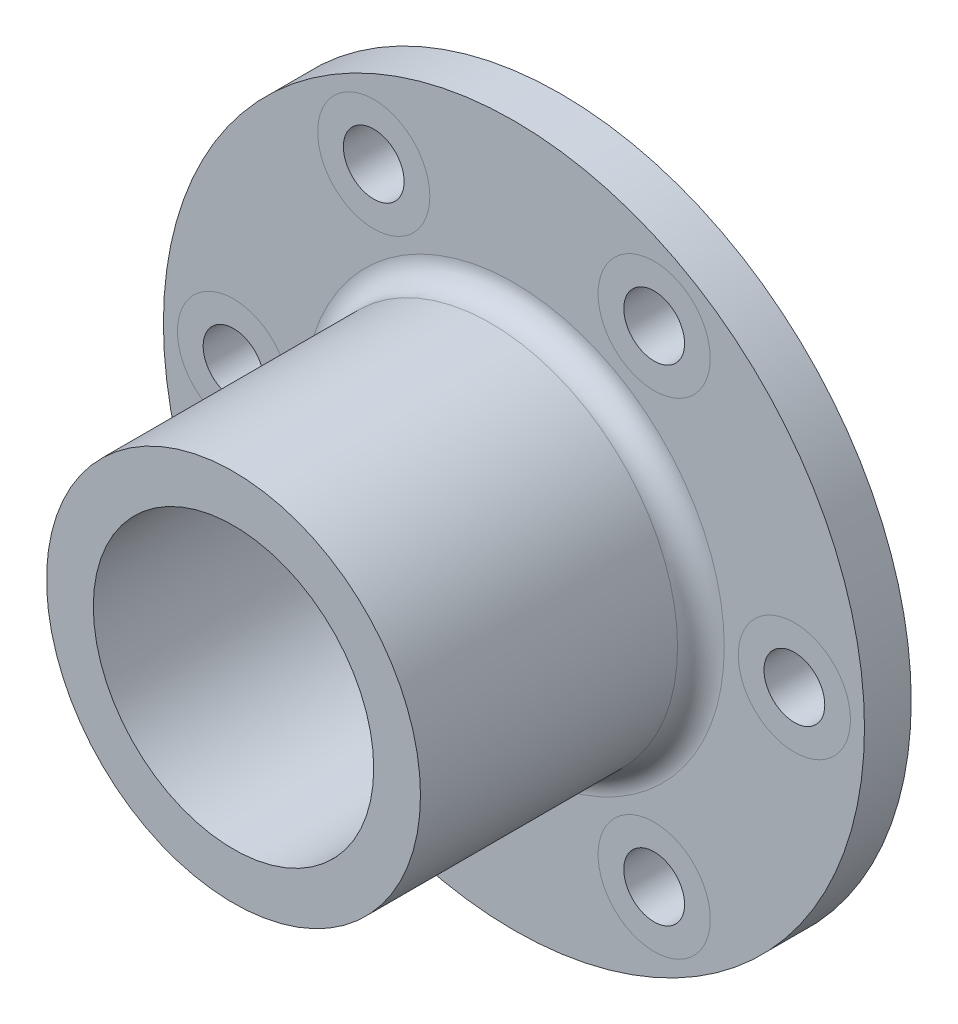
ISO-10303-21;
HEADER;
FILE_DESCRIPTION(('STEP AP214'),'2;1');
FILE_NAME('part.step','',(''),(''),'','','');
FILE_SCHEMA(('AUTOMOTIVE_DESIGN { 1 0 10303 214 1 1 1 1 }'));
ENDSEC;
DATA;
#1=APPLICATION_CONTEXT('core data for automotive mechanical design processes');
#2=APPLICATION_PROTOCOL_DEFINITION('international standard','automotive_design',2000,#1);
#3=PRODUCT_CONTEXT('',#1,'mechanical');
#4=PRODUCT('Part','Part','',(#3));
#5=PRODUCT_RELATED_PRODUCT_CATEGORY('part','',(#4));
#6=PRODUCT_DEFINITION_FORMATION('','',#4);
#7=PRODUCT_DEFINITION_CONTEXT('part definition',#1,'design');
#8=PRODUCT_DEFINITION('design','',#6,#7);
#9=PRODUCT_DEFINITION_SHAPE('','',#8);
#10=(LENGTH_UNIT() NAMED_UNIT(*) SI_UNIT(.MILLI.,.METRE.));
#11=(NAMED_UNIT(*) PLANE_ANGLE_UNIT() SI_UNIT($,.RADIAN.));
#12=(NAMED_UNIT(*) SI_UNIT($,.STERADIAN.) SOLID_ANGLE_UNIT());
#13=UNCERTAINTY_MEASURE_WITH_UNIT(LENGTH_MEASURE(1.E-05),#10,'distance_accuracy_value','');
#14=(GEOMETRIC_REPRESENTATION_CONTEXT(3) GLOBAL_UNCERTAINTY_ASSIGNED_CONTEXT((#13)) GLOBAL_UNIT_ASSIGNED_CONTEXT((#10,
#11,#12)) REPRESENTATION_CONTEXT('',''));
#15=CARTESIAN_POINT('',(0.,0.,0.));
#16=DIRECTION('',(0.,0.,1.));
#17=DIRECTION('',(1.,0.,0.));
#18=AXIS2_PLACEMENT_3D('',#15,#16,#17);
#19=CARTESIAN_POINT('',(0.,0.,10.));
#20=DIRECTION('',(0.,0.,1.));
#21=DIRECTION('',(1.,0.,0.));
#22=AXIS2_PLACEMENT_3D('',#19,#20,#21);
#23=PLANE('',#22);
#24=CARTESIAN_POINT('',(-29.9999999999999,51.9615242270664,10.));
#25=DIRECTION('',(0.,0.,1.));
#26=DIRECTION('',(1.,0.,0.));
#27=AXIS2_PLACEMENT_3D('',#24,#25,#26);
#28=CIRCLE('',#27,12.);
#29=CARTESIAN_POINT('',(-17.9999999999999,51.9615242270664,10.));
#30=VERTEX_POINT('',#29);
#31=EDGE_CURVE('E42',#30,#30,#28,.F.);
#32=ORIENTED_EDGE('',*,*,#31,.T.);
#33=EDGE_LOOP('',(#32));
#34=FACE_BOUND('',#33,.T.);
#35=CARTESIAN_POINT('',(60.,-4.18935719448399E-13,10.));
#36=DIRECTION('',(0.,0.,1.));
#37=DIRECTION('',(1.,0.,0.));
#38=AXIS2_PLACEMENT_3D('',#35,#36,#37);
#39=CIRCLE('',#38,12.);
#40=CARTESIAN_POINT('',(72.,-4.18935719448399E-13,10.));
#41=VERTEX_POINT('',#40);
#42=EDGE_CURVE('E56',#41,#41,#39,.F.);
#43=ORIENTED_EDGE('',*,*,#42,.T.);
#44=EDGE_LOOP('',(#43));
#45=FACE_BOUND('',#44,.T.);
#46=CARTESIAN_POINT('',(-30.0000000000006,-51.961524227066,10.));
#47=DIRECTION('',(0.,0.,1.));
#48=DIRECTION('',(1.,0.,0.));
#49=AXIS2_PLACEMENT_3D('',#46,#47,#48);
#50=CIRCLE('',#49,12.);
#51=CARTESIAN_POINT('',(-18.0000000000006,-51.961524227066,10.));
#52=VERTEX_POINT('',#51);
#53=EDGE_CURVE('E66',#52,#52,#50,.F.);
#54=ORIENTED_EDGE('',*,*,#53,.T.);
#55=EDGE_LOOP('',(#54));
#56=FACE_BOUND('',#55,.T.);
#57=CARTESIAN_POINT('',(0.,0.,10.));
#58=DIRECTION('',(0.,0.,1.));
#59=DIRECTION('',(1.,0.,0.));
#60=AXIS2_PLACEMENT_3D('',#57,#58,#59);
#61=CIRCLE('',#60,45.);
#62=CARTESIAN_POINT('',(45.,0.,10.));
#63=VERTEX_POINT('',#62);
#64=EDGE_CURVE('E70',#63,#63,#61,.F.);
#65=ORIENTED_EDGE('',*,*,#64,.T.);
#66=EDGE_LOOP('',(#65));
#67=FACE_BOUND('',#66,.T.);
#68=CARTESIAN_POINT('',(0.,0.,10.));
#69=DIRECTION('',(0.,0.,1.));
#70=DIRECTION('',(1.,0.,0.));
#71=AXIS2_PLACEMENT_3D('',#68,#69,#70);
#72=CIRCLE('',#71,75.);
#73=CARTESIAN_POINT('',(75.,0.,10.));
#74=VERTEX_POINT('',#73);
#75=EDGE_CURVE('E76',#74,#74,#72,.T.);
#76=ORIENTED_EDGE('',*,*,#75,.T.);
#77=EDGE_LOOP('',(#76));
#78=FACE_BOUND('',#77,.T.);
#79=CARTESIAN_POINT('',(29.9999999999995,-51.9615242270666,10.));
#80=DIRECTION('',(0.,0.,1.));
#81=DIRECTION('',(1.,0.,0.));
#82=AXIS2_PLACEMENT_3D('',#79,#80,#81);
#83=CIRCLE('',#82,12.);
#84=CARTESIAN_POINT('',(41.9999999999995,-51.9615242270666,10.));
#85=VERTEX_POINT('',#84);
#86=EDGE_CURVE('E62',#85,#85,#83,.F.);
#87=ORIENTED_EDGE('',*,*,#86,.T.);
#88=EDGE_LOOP('',(#87));
#89=FACE_BOUND('',#88,.T.);
#90=CARTESIAN_POINT('',(30.0000000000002,51.9615242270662,10.));
#91=DIRECTION('',(0.,0.,1.));
#92=DIRECTION('',(1.,0.,0.));
#93=AXIS2_PLACEMENT_3D('',#90,#91,#92);
#94=CIRCLE('',#93,12.);
#95=CARTESIAN_POINT('',(42.0000000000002,51.9615242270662,10.));
#96=VERTEX_POINT('',#95);
#97=EDGE_CURVE('E49',#96,#96,#94,.F.);
#98=ORIENTED_EDGE('',*,*,#97,.T.);
#99=EDGE_LOOP('',(#98));
#100=FACE_BOUND('',#99,.T.);
#101=CARTESIAN_POINT('',(-60.,0.,10.));
#102=DIRECTION('',(0.,0.,1.));
#103=DIRECTION('',(1.,0.,0.));
#104=AXIS2_PLACEMENT_3D('',#101,#102,#103);
#105=CIRCLE('',#104,12.);
#106=CARTESIAN_POINT('',(-48.,0.,10.));
#107=VERTEX_POINT('',#106);
#108=EDGE_CURVE('E10',#107,#107,#105,.F.);
#109=ORIENTED_EDGE('',*,*,#108,.T.);
#110=EDGE_LOOP('',(#109));
#111=FACE_BOUND('',#110,.T.);
#112=ADVANCED_FACE('F34',(#34,#45,#56,#67,#78,#89,#100,#111),#23,.T.);
#113=ORIENTED_EDGE('',*,*,#108,.F.);
#114=EDGE_LOOP('',(#113));
#115=FACE_BOUND('',#114,.T.);
#116=CARTESIAN_POINT('',(-60.,0.,10.));
#117=DIRECTION('',(0.,0.,1.));
#118=DIRECTION('',(1.,0.,0.));
#119=AXIS2_PLACEMENT_3D('',#116,#117,#118);
#120=CIRCLE('',#119,6.5);
#121=CARTESIAN_POINT('',(-53.5,0.,10.));
#122=VERTEX_POINT('',#121);
#123=EDGE_CURVE('E89',#122,#122,#120,.T.);
#124=ORIENTED_EDGE('',*,*,#123,.F.);
#125=EDGE_LOOP('',(#124));
#126=FACE_BOUND('',#125,.T.);
#127=ADVANCED_FACE('F161',(#115,#126),#23,.T.);
#128=ORIENTED_EDGE('',*,*,#31,.F.);
#129=EDGE_LOOP('',(#128));
#130=FACE_BOUND('',#129,.T.);
#131=CARTESIAN_POINT('',(-29.9999999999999,51.9615242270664,10.));
#132=DIRECTION('',(0.,0.,1.));
#133=DIRECTION('',(1.,0.,0.));
#134=AXIS2_PLACEMENT_3D('',#131,#132,#133);
#135=CIRCLE('',#134,6.5);
#136=CARTESIAN_POINT('',(-23.4999999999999,51.9615242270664,10.));
#137=VERTEX_POINT('',#136);
#138=EDGE_CURVE('E97',#137,#137,#135,.T.);
#139=ORIENTED_EDGE('',*,*,#138,.F.);
#140=EDGE_LOOP('',(#139));
#141=FACE_BOUND('',#140,.T.);
#142=ADVANCED_FACE('F165',(#130,#141),#23,.T.);
#143=ORIENTED_EDGE('',*,*,#97,.F.);
#144=EDGE_LOOP('',(#143));
#145=FACE_BOUND('',#144,.T.);
#146=CARTESIAN_POINT('',(30.0000000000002,51.9615242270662,10.));
#147=DIRECTION('',(0.,0.,1.));
#148=DIRECTION('',(1.,0.,0.));
#149=AXIS2_PLACEMENT_3D('',#146,#147,#148);
#150=CIRCLE('',#149,6.5);
#151=CARTESIAN_POINT('',(36.5000000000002,51.9615242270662,10.));
#152=VERTEX_POINT('',#151);
#153=EDGE_CURVE('E103',#152,#152,#150,.T.);
#154=ORIENTED_EDGE('',*,*,#153,.F.);
#155=EDGE_LOOP('',(#154));
#156=FACE_BOUND('',#155,.T.);
#157=ADVANCED_FACE('F300',(#145,#156),#23,.T.);
#158=ORIENTED_EDGE('',*,*,#42,.F.);
#159=EDGE_LOOP('',(#158));
#160=FACE_BOUND('',#159,.T.);
#161=CARTESIAN_POINT('',(60.,-4.18978003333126E-13,10.));
#162=DIRECTION('',(0.,0.,1.));
#163=DIRECTION('',(1.,0.,0.));
#164=AXIS2_PLACEMENT_3D('',#161,#162,#163);
#165=CIRCLE('',#164,6.5);
#166=CARTESIAN_POINT('',(66.5,-4.18978003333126E-13,10.));
#167=VERTEX_POINT('',#166);
#168=EDGE_CURVE('E109',#167,#167,#165,.T.);
#169=ORIENTED_EDGE('',*,*,#168,.F.);
#170=EDGE_LOOP('',(#169));
#171=FACE_BOUND('',#170,.T.);
#172=ADVANCED_FACE('F289',(#160,#171),#23,.T.);
#173=ORIENTED_EDGE('',*,*,#86,.F.);
#174=EDGE_LOOP('',(#173));
#175=FACE_BOUND('',#174,.T.);
#176=CARTESIAN_POINT('',(29.9999999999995,-51.9615242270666,10.));
#177=DIRECTION('',(0.,0.,1.));
#178=DIRECTION('',(1.,0.,0.));
#179=AXIS2_PLACEMENT_3D('',#176,#177,#178);
#180=CIRCLE('',#179,6.5);
#181=CARTESIAN_POINT('',(36.4999999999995,-51.9615242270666,10.));
#182=VERTEX_POINT('',#181);
#183=EDGE_CURVE('E115',#182,#182,#180,.T.);
#184=ORIENTED_EDGE('',*,*,#183,.F.);
#185=EDGE_LOOP('',(#184));
#186=FACE_BOUND('',#185,.T.);
#187=ADVANCED_FACE('F156',(#175,#186),#23,.T.);
#188=ORIENTED_EDGE('',*,*,#53,.F.);
#189=EDGE_LOOP('',(#188));
#190=FACE_BOUND('',#189,.T.);
#191=CARTESIAN_POINT('',(-30.0000000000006,-51.961524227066,10.));
#192=DIRECTION('',(0.,0.,1.));
#193=DIRECTION('',(1.,0.,0.));
#194=AXIS2_PLACEMENT_3D('',#191,#192,#193);
#195=CIRCLE('',#194,6.5);
#196=CARTESIAN_POINT('',(-23.5000000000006,-51.961524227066,10.));
#197=VERTEX_POINT('',#196);
#198=EDGE_CURVE('E121',#197,#197,#195,.T.);
#199=ORIENTED_EDGE('',*,*,#198,.F.);
#200=EDGE_LOOP('',(#199));
#201=FACE_BOUND('',#200,.T.);
#202=ADVANCED_FACE('F151',(#190,#201),#23,.T.);
#203=CARTESIAN_POINT('',(0.,0.,10.));
#204=DIRECTION('',(0.,0.,-1.));
#205=DIRECTION('',(-1.,0.,0.));
#206=AXIS2_PLACEMENT_3D('',#203,#204,#205);
#207=CYLINDRICAL_SURFACE('',#206,75.);
#208=ORIENTED_EDGE('',*,*,#75,.F.);
#209=EDGE_LOOP('',(#208));
#210=FACE_BOUND('',#209,.T.);
#211=CARTESIAN_POINT('',(0.,0.,0.));
#212=DIRECTION('',(0.,0.,1.));
#213=DIRECTION('',(1.,0.,0.));
#214=AXIS2_PLACEMENT_3D('',#211,#212,#213);
#215=CIRCLE('',#214,75.);
#216=CARTESIAN_POINT('',(75.,0.,0.));
#217=VERTEX_POINT('',#216);
#218=EDGE_CURVE('E79',#217,#217,#215,.T.);
#219=ORIENTED_EDGE('',*,*,#218,.T.);
#220=EDGE_LOOP('',(#219));
#221=FACE_BOUND('',#220,.T.);
#222=ADVANCED_FACE('F134',(#210,#221),#207,.T.);
#223=CARTESIAN_POINT('',(0.,0.,0.));
#224=DIRECTION('',(0.,0.,1.));
#225=DIRECTION('',(1.,0.,0.));
#226=AXIS2_PLACEMENT_3D('',#223,#224,#225);
#227=PLANE('',#226);
#228=CARTESIAN_POINT('',(-30.0000000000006,-51.961524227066,0.));
#229=DIRECTION('',(0.,0.,-1.));
#230=DIRECTION('',(-0.50000000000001,-0.866025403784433,0.));
#231=AXIS2_PLACEMENT_3D('',#228,#229,#230);
#232=CIRCLE('',#231,6.5);
#233=CARTESIAN_POINT('',(-33.2500000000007,-57.5906893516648,0.));
#234=VERTEX_POINT('',#233);
#235=EDGE_CURVE('E124',#234,#234,#232,.T.);
#236=ORIENTED_EDGE('',*,*,#235,.F.);
#237=EDGE_LOOP('',(#236));
#238=FACE_BOUND('',#237,.T.);
#239=CARTESIAN_POINT('',(29.9999999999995,-51.9615242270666,0.));
#240=DIRECTION('',(0.,0.,-1.));
#241=DIRECTION('',(0.499999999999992,-0.866025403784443,0.));
#242=AXIS2_PLACEMENT_3D('',#239,#240,#241);
#243=CIRCLE('',#242,6.5);
#244=CARTESIAN_POINT('',(33.2499999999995,-57.5906893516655,0.));
#245=VERTEX_POINT('',#244);
#246=EDGE_CURVE('E118',#245,#245,#243,.T.);
#247=ORIENTED_EDGE('',*,*,#246,.F.);
#248=EDGE_LOOP('',(#247));
#249=FACE_BOUND('',#248,.T.);
#250=CARTESIAN_POINT('',(60.,-4.18978003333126E-13,0.));
#251=DIRECTION('',(0.,0.,-1.));
#252=DIRECTION('',(1.,0.,0.));
#253=AXIS2_PLACEMENT_3D('',#250,#251,#252);
#254=CIRCLE('',#253,6.5);
#255=CARTESIAN_POINT('',(66.5,-4.64367287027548E-13,0.));
#256=VERTEX_POINT('',#255);
#257=EDGE_CURVE('E112',#256,#256,#254,.T.);
#258=ORIENTED_EDGE('',*,*,#257,.F.);
#259=EDGE_LOOP('',(#258));
#260=FACE_BOUND('',#259,.T.);
#261=CARTESIAN_POINT('',(30.0000000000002,51.9615242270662,0.));
#262=DIRECTION('',(0.,0.,-1.));
#263=DIRECTION('',(0.500000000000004,0.866025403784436,0.));
#264=AXIS2_PLACEMENT_3D('',#261,#262,#263);
#265=CIRCLE('',#264,6.5);
#266=CARTESIAN_POINT('',(33.2500000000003,57.590689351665,0.));
#267=VERTEX_POINT('',#266);
#268=EDGE_CURVE('E106',#267,#267,#265,.T.);
#269=ORIENTED_EDGE('',*,*,#268,.F.);
#270=EDGE_LOOP('',(#269));
#271=FACE_BOUND('',#270,.T.);
#272=CARTESIAN_POINT('',(-29.9999999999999,51.9615242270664,0.));
#273=DIRECTION('',(0.,0.,-1.));
#274=DIRECTION('',(-0.499999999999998,0.86602540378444,0.));
#275=AXIS2_PLACEMENT_3D('',#272,#273,#274);
#276=CIRCLE('',#275,6.5);
#277=CARTESIAN_POINT('',(-33.2499999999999,57.5906893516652,0.));
#278=VERTEX_POINT('',#277);
#279=EDGE_CURVE('E100',#278,#278,#276,.T.);
#280=ORIENTED_EDGE('',*,*,#279,.F.);
#281=EDGE_LOOP('',(#280));
#282=FACE_BOUND('',#281,.T.);
#283=CARTESIAN_POINT('',(-60.,0.,0.));
#284=DIRECTION('',(0.,0.,-1.));
#285=DIRECTION('',(-1.,0.,0.));
#286=AXIS2_PLACEMENT_3D('',#283,#284,#285);
#287=CIRCLE('',#286,6.5);
#288=CARTESIAN_POINT('',(-66.5,0.,0.));
#289=VERTEX_POINT('',#288);
#290=EDGE_CURVE('E94',#289,#289,#287,.T.);
#291=ORIENTED_EDGE('',*,*,#290,.F.);
#292=EDGE_LOOP('',(#291));
#293=FACE_BOUND('',#292,.T.);
#294=CARTESIAN_POINT('',(0.,0.,0.));
#295=DIRECTION('',(0.,0.,1.));
#296=DIRECTION('',(1.,0.,0.));
#297=AXIS2_PLACEMENT_3D('',#294,#295,#296);
#298=CIRCLE('',#297,30.);
#299=CARTESIAN_POINT('',(30.,0.,0.));
#300=VERTEX_POINT('',#299);
#301=EDGE_CURVE('E85',#300,#300,#298,.T.);
#302=ORIENTED_EDGE('',*,*,#301,.T.);
#303=EDGE_LOOP('',(#302));
#304=FACE_BOUND('',#303,.T.);
#305=ORIENTED_EDGE('',*,*,#218,.F.);
#306=EDGE_LOOP('',(#305));
#307=FACE_BOUND('',#306,.T.);
#308=ADVANCED_FACE('F130',(#238,#249,#260,#271,#282,#293,#304,#307),#227,.F.);
#309=CARTESIAN_POINT('',(0.,0.,70.));
#310=DIRECTION('',(0.,0.,-1.));
#311=DIRECTION('',(-1.,0.,0.));
#312=AXIS2_PLACEMENT_3D('',#309,#310,#311);
#313=CYLINDRICAL_SURFACE('',#312,40.);
#314=CARTESIAN_POINT('',(0.,0.,15.));
#315=DIRECTION('',(0.,0.,1.));
#316=DIRECTION('',(1.,0.,0.));
#317=AXIS2_PLACEMENT_3D('',#314,#315,#316);
#318=CIRCLE('',#317,40.);
#319=CARTESIAN_POINT('',(40.,0.,15.));
#320=VERTEX_POINT('',#319);
#321=EDGE_CURVE('E73',#320,#320,#318,.T.);
#322=ORIENTED_EDGE('',*,*,#321,.T.);
#323=EDGE_LOOP('',(#322));
#324=FACE_BOUND('',#323,.T.);
#325=CARTESIAN_POINT('',(0.,0.,70.));
#326=DIRECTION('',(0.,0.,1.));
#327=DIRECTION('',(1.,0.,0.));
#328=AXIS2_PLACEMENT_3D('',#325,#326,#327);
#329=CIRCLE('',#328,40.);
#330=CARTESIAN_POINT('',(40.,0.,70.));
#331=VERTEX_POINT('',#330);
#332=EDGE_CURVE('E82',#331,#331,#329,.T.);
#333=ORIENTED_EDGE('',*,*,#332,.F.);
#334=EDGE_LOOP('',(#333));
#335=FACE_BOUND('',#334,.T.);
#336=ADVANCED_FACE('F133',(#324,#335),#313,.T.);
#337=CARTESIAN_POINT('',(0.,0.,70.));
#338=DIRECTION('',(0.,0.,1.));
#339=DIRECTION('',(1.,0.,0.));
#340=AXIS2_PLACEMENT_3D('',#337,#338,#339);
#341=PLANE('',#340);
#342=CARTESIAN_POINT('',(0.,0.,70.));
#343=DIRECTION('',(0.,0.,1.));
#344=DIRECTION('',(1.,0.,0.));
#345=AXIS2_PLACEMENT_3D('',#342,#343,#344);
#346=CIRCLE('',#345,30.);
#347=CARTESIAN_POINT('',(30.,0.,70.));
#348=VERTEX_POINT('',#347);
#349=EDGE_CURVE('E86',#348,#348,#346,.T.);
#350=ORIENTED_EDGE('',*,*,#349,.F.);
#351=EDGE_LOOP('',(#350));
#352=FACE_BOUND('',#351,.T.);
#353=ORIENTED_EDGE('',*,*,#332,.T.);
#354=EDGE_LOOP('',(#353));
#355=FACE_BOUND('',#354,.T.);
#356=ADVANCED_FACE('F171',(#352,#355),#341,.T.);
#357=CARTESIAN_POINT('',(0.,0.,0.));
#358=DIRECTION('',(0.,0.,1.));
#359=DIRECTION('',(1.,0.,0.));
#360=AXIS2_PLACEMENT_3D('',#357,#358,#359);
#361=CYLINDRICAL_SURFACE('',#360,30.);
#362=ORIENTED_EDGE('',*,*,#301,.F.);
#363=EDGE_LOOP('',(#362));
#364=FACE_BOUND('',#363,.T.);
#365=ORIENTED_EDGE('',*,*,#349,.T.);
#366=EDGE_LOOP('',(#365));
#367=FACE_BOUND('',#366,.T.);
#368=ADVANCED_FACE('F175',(#364,#367),#361,.F.);
#369=CARTESIAN_POINT('',(0.,0.,15.));
#370=DIRECTION('',(0.,0.,1.));
#371=DIRECTION('',(1.,0.,0.));
#372=AXIS2_PLACEMENT_3D('',#369,#370,#371);
#373=TOROIDAL_SURFACE('',#372,45.,5.);
#374=ORIENTED_EDGE('',*,*,#64,.F.);
#375=EDGE_LOOP('',(#374));
#376=FACE_BOUND('',#375,.T.);
#377=ORIENTED_EDGE('',*,*,#321,.F.);
#378=EDGE_LOOP('',(#377));
#379=FACE_BOUND('',#378,.T.);
#380=ADVANCED_FACE('F36',(#376,#379),#373,.F.);
#381=CARTESIAN_POINT('',(-60.,0.,70.));
#382=DIRECTION('',(0.,0.,-1.));
#383=DIRECTION('',(-1.,0.,0.));
#384=AXIS2_PLACEMENT_3D('',#381,#382,#383);
#385=CYLINDRICAL_SURFACE('',#384,6.5);
#386=ORIENTED_EDGE('',*,*,#123,.T.);
#387=EDGE_LOOP('',(#386));
#388=FACE_BOUND('',#387,.T.);
#389=ORIENTED_EDGE('',*,*,#290,.T.);
#390=EDGE_LOOP('',(#389));
#391=FACE_BOUND('',#390,.T.);
#392=ADVANCED_FACE('F180',(#388,#391),#385,.F.);
#393=CARTESIAN_POINT('',(-29.9999999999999,51.9615242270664,70.));
#394=DIRECTION('',(0.,0.,-1.));
#395=DIRECTION('',(-1.,0.,0.));
#396=AXIS2_PLACEMENT_3D('',#393,#394,#395);
#397=CYLINDRICAL_SURFACE('',#396,6.5);
#398=ORIENTED_EDGE('',*,*,#138,.T.);
#399=EDGE_LOOP('',(#398));
#400=FACE_BOUND('',#399,.T.);
#401=ORIENTED_EDGE('',*,*,#279,.T.);
#402=EDGE_LOOP('',(#401));
#403=FACE_BOUND('',#402,.T.);
#404=ADVANCED_FACE('F183',(#400,#403),#397,.F.);
#405=CARTESIAN_POINT('',(30.0000000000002,51.9615242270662,70.));
#406=DIRECTION('',(0.,0.,-1.));
#407=DIRECTION('',(-1.,0.,0.));
#408=AXIS2_PLACEMENT_3D('',#405,#406,#407);
#409=CYLINDRICAL_SURFACE('',#408,6.5);
#410=ORIENTED_EDGE('',*,*,#153,.T.);
#411=EDGE_LOOP('',(#410));
#412=FACE_BOUND('',#411,.T.);
#413=ORIENTED_EDGE('',*,*,#268,.T.);
#414=EDGE_LOOP('',(#413));
#415=FACE_BOUND('',#414,.T.);
#416=ADVANCED_FACE('F187',(#412,#415),#409,.F.);
#417=CARTESIAN_POINT('',(60.,-4.18978003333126E-13,70.));
#418=DIRECTION('',(0.,0.,-1.));
#419=DIRECTION('',(-1.,0.,0.));
#420=AXIS2_PLACEMENT_3D('',#417,#418,#419);
#421=CYLINDRICAL_SURFACE('',#420,6.5);
#422=ORIENTED_EDGE('',*,*,#168,.T.);
#423=EDGE_LOOP('',(#422));
#424=FACE_BOUND('',#423,.T.);
#425=ORIENTED_EDGE('',*,*,#257,.T.);
#426=EDGE_LOOP('',(#425));
#427=FACE_BOUND('',#426,.T.);
#428=ADVANCED_FACE('F191',(#424,#427),#421,.F.);
#429=CARTESIAN_POINT('',(29.9999999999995,-51.9615242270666,70.));
#430=DIRECTION('',(0.,0.,-1.));
#431=DIRECTION('',(-1.,0.,0.));
#432=AXIS2_PLACEMENT_3D('',#429,#430,#431);
#433=CYLINDRICAL_SURFACE('',#432,6.5);
#434=ORIENTED_EDGE('',*,*,#183,.T.);
#435=EDGE_LOOP('',(#434));
#436=FACE_BOUND('',#435,.T.);
#437=ORIENTED_EDGE('',*,*,#246,.T.);
#438=EDGE_LOOP('',(#437));
#439=FACE_BOUND('',#438,.T.);
#440=ADVANCED_FACE('F195',(#436,#439),#433,.F.);
#441=CARTESIAN_POINT('',(-30.0000000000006,-51.961524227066,70.));
#442=DIRECTION('',(0.,0.,-1.));
#443=DIRECTION('',(-1.,0.,0.));
#444=AXIS2_PLACEMENT_3D('',#441,#442,#443);
#445=CYLINDRICAL_SURFACE('',#444,6.5);
#446=ORIENTED_EDGE('',*,*,#198,.T.);
#447=EDGE_LOOP('',(#446));
#448=FACE_BOUND('',#447,.T.);
#449=ORIENTED_EDGE('',*,*,#235,.T.);
#450=EDGE_LOOP('',(#449));
#451=FACE_BOUND('',#450,.T.);
#452=ADVANCED_FACE('F128',(#448,#451),#445,.F.);
#453=CLOSED_SHELL('',(#112,#127,#142,#157,#172,#187,#202,#222,#308,#336,#356,#368,#380,#392,
#404,#416,#428,#440,#452));
#454=MANIFOLD_SOLID_BREP('B2',#453);
#455=ADVANCED_BREP_SHAPE_REPRESENTATION('',(#18,#454),#14);
#456=SHAPE_DEFINITION_REPRESENTATION(#9,#455);
ENDSEC;
END-ISO-10303-21;
